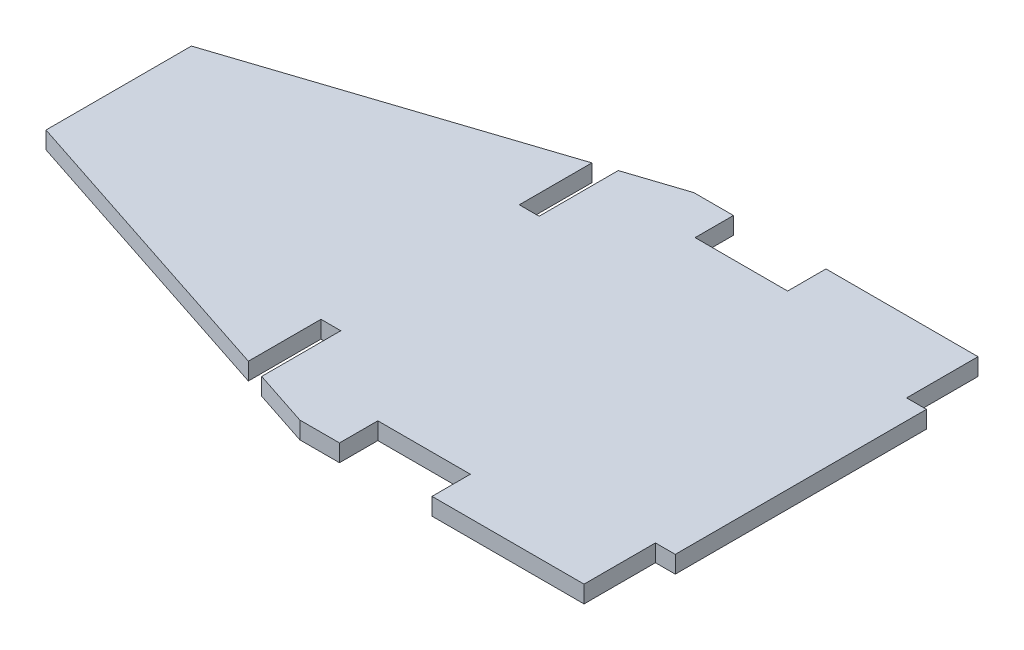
from build123d import *

# Parameters (mm, degrees)
BOSS_EXTRU_1_DEPTH = 1.3


with BuildPart() as part:
    # Esquisse1 → Boss.-Extru.1 (new body)
    with BuildSketch(Plane(origin=(0, 0, 0), x_dir=(1, 0, 0), z_dir=(0, 1, 0))):
        Polygon((51.6, 9.5), (51.6, -9.5), (50.1, -9.5), (50.1, -14.9), (38.6, -14.9), (38.6, -12), (31.6, -12), (31.6, -14.9), (28.6, -14.9), (24.3, -13.486713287), (24.3, -7.5), (22.8, -7.5), (22.8, -12.993706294), (0, -5.5), (0, 5.5), (22.8, 12.993706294), (22.8, 7.5), (24.3, 7.5), (24.3, 13.486713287), (28.6, 14.9), (31.6, 14.9), (31.6, 12), (38.6, 12), (38.6, 14.9), (50.1, 14.9), (50.1, 9.5), align=None)
    extrude(amount=BOSS_EXTRU_1_DEPTH)


solid = part.part
